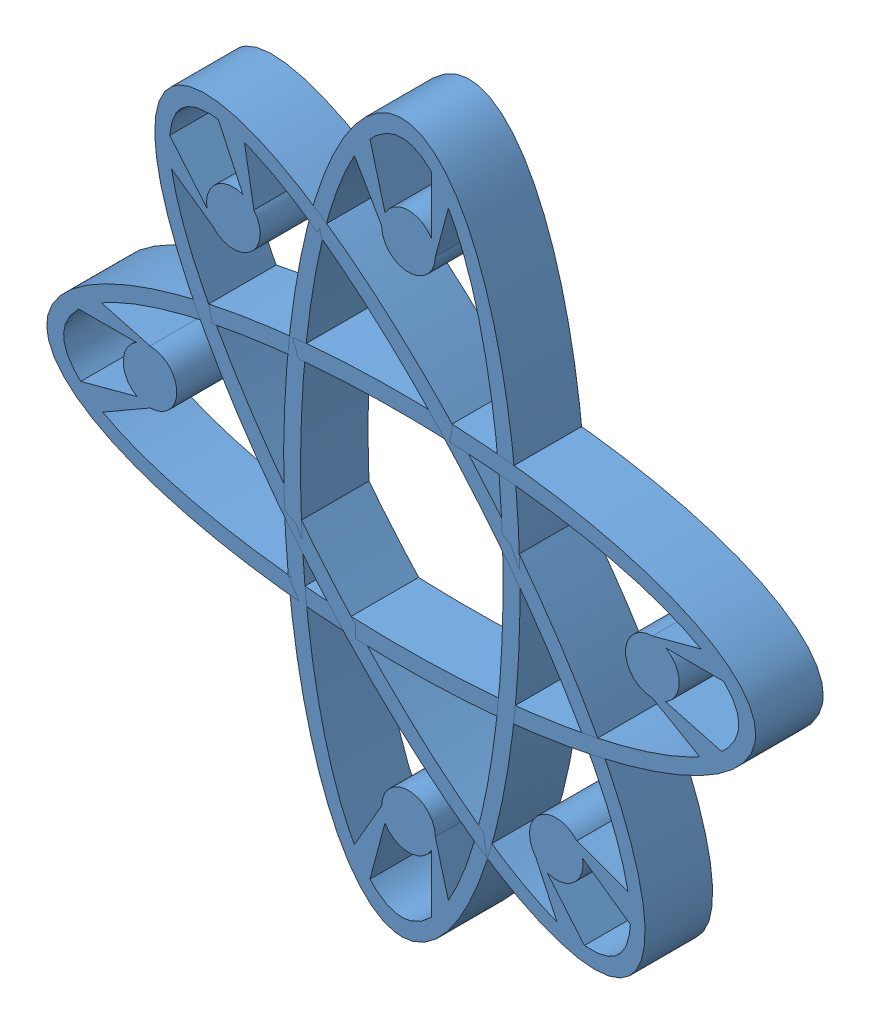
SolidWorks assembly Assem1.sldasm, configuration Default (file format 10000). Lengths in mm.
Overall size (105 105 10).
3 component instances, 1 part files, 2 mates.
Components (placement in the parent):
- 3d-1: 3d.SLDPRT [Default] at (20.4036 64.5815 78.8628) size (105 35 10)
- 3d-2: 3d.SLDPRT [Default] at (20.4884 64.911 78.8628) x (0 -1 0) z (0 0 1) size (105 35 10)
- 3d-4: 3d.SLDPRT [Default] at (20.2114 64.259 78.8628) x (-0.642788 0.766044 0) z (0 0 1) size (105 35 10)
Mates (geometry in assembly coordinates):
- Coincident3: coincident aligned: plane of 3d-1 through (20.4036 64.5815 78.8628) normal (0 0 -1); plane of 3d-2 through (20.4884 64.911 78.8628) normal (0 0 -1)
- Coincident4: coincident aligned: plane of 3d-2 through (20.4884 64.911 78.8628) normal (0 0 -1); plane of 3d-4 through (20.2114 64.259 78.8628) normal (0 0 -1)
